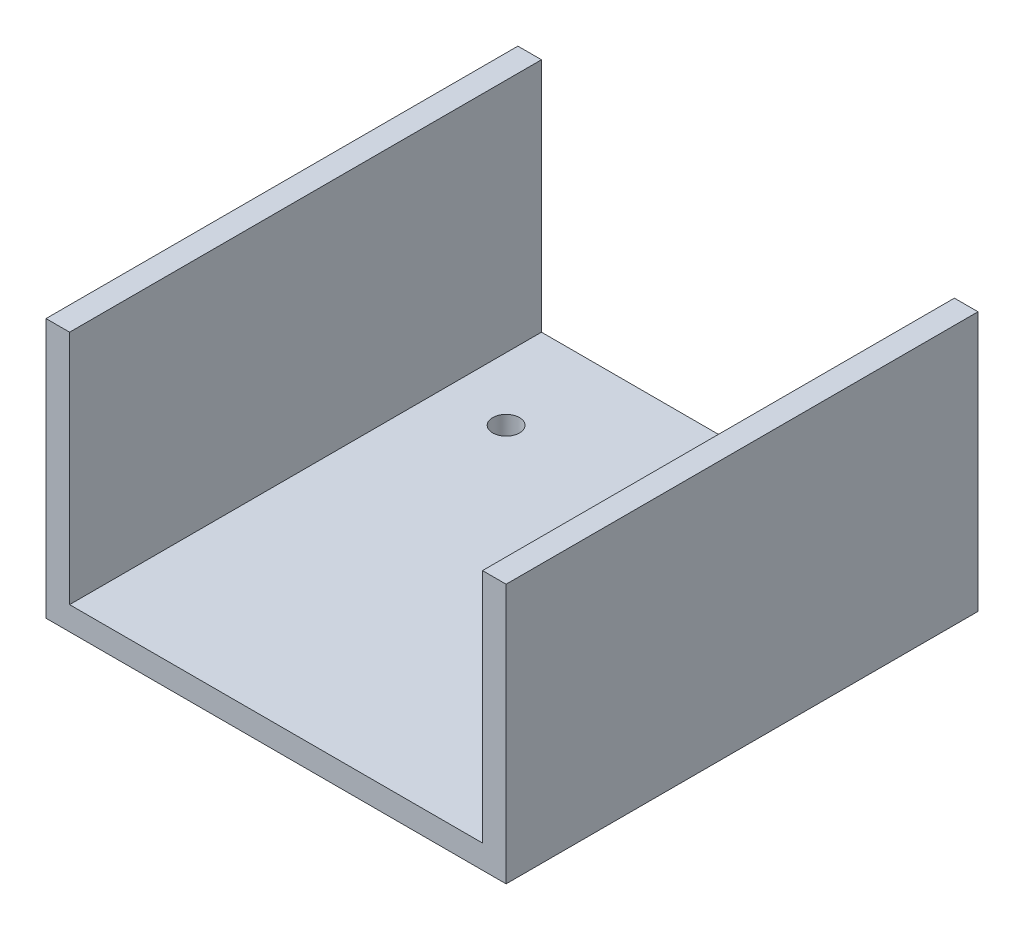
ISO-10303-21;
HEADER;
FILE_DESCRIPTION(('STEP AP214'),'2;1');
FILE_NAME('part.step','',(''),(''),'','','');
FILE_SCHEMA(('AUTOMOTIVE_DESIGN { 1 0 10303 214 1 1 1 1 }'));
ENDSEC;
DATA;
#1=APPLICATION_CONTEXT('core data for automotive mechanical design processes');
#2=APPLICATION_PROTOCOL_DEFINITION('international standard','automotive_design',2000,#1);
#3=PRODUCT_CONTEXT('',#1,'mechanical');
#4=PRODUCT('Part','Part','',(#3));
#5=PRODUCT_RELATED_PRODUCT_CATEGORY('part','',(#4));
#6=PRODUCT_DEFINITION_FORMATION('','',#4);
#7=PRODUCT_DEFINITION_CONTEXT('part definition',#1,'design');
#8=PRODUCT_DEFINITION('design','',#6,#7);
#9=PRODUCT_DEFINITION_SHAPE('','',#8);
#10=(LENGTH_UNIT() NAMED_UNIT(*) SI_UNIT(.MILLI.,.METRE.));
#11=(NAMED_UNIT(*) PLANE_ANGLE_UNIT() SI_UNIT($,.RADIAN.));
#12=(NAMED_UNIT(*) SI_UNIT($,.STERADIAN.) SOLID_ANGLE_UNIT());
#13=UNCERTAINTY_MEASURE_WITH_UNIT(LENGTH_MEASURE(1.E-05),#10,'distance_accuracy_value','');
#14=(GEOMETRIC_REPRESENTATION_CONTEXT(3) GLOBAL_UNCERTAINTY_ASSIGNED_CONTEXT((#13)) GLOBAL_UNIT_ASSIGNED_CONTEXT((#10,
#11,#12)) REPRESENTATION_CONTEXT('',''));
#15=CARTESIAN_POINT('',(0.,0.,0.));
#16=DIRECTION('',(0.,0.,1.));
#17=DIRECTION('',(1.,0.,0.));
#18=AXIS2_PLACEMENT_3D('',#15,#16,#17);
#19=CARTESIAN_POINT('',(52.5,-27.,120.));
#20=DIRECTION('',(1.,0.,0.));
#21=DIRECTION('',(0.,0.,-1.));
#22=AXIS2_PLACEMENT_3D('',#19,#20,#21);
#23=PLANE('',#22);
#24=DIRECTION('',(0.,-1.,0.));
#25=VECTOR('',#24,1.);
#26=CARTESIAN_POINT('',(52.5,-27.,0.));
#27=LINE('',#26,#25);
#28=CARTESIAN_POINT('',(52.5,33.,0.));
#29=VERTEX_POINT('',#28);
#30=CARTESIAN_POINT('',(52.5,-27.,0.));
#31=VERTEX_POINT('',#30);
#32=EDGE_CURVE('E126',#29,#31,#27,.T.);
#33=ORIENTED_EDGE('',*,*,#32,.T.);
#34=DIRECTION('',(0.,0.,-1.));
#35=VECTOR('',#34,1.);
#36=CARTESIAN_POINT('',(52.5,-27.,120.));
#37=LINE('',#36,#35);
#38=CARTESIAN_POINT('',(52.5,-27.,120.));
#39=VERTEX_POINT('',#38);
#40=EDGE_CURVE('E11',#39,#31,#37,.T.);
#41=ORIENTED_EDGE('',*,*,#40,.F.);
#42=DIRECTION('',(0.,-1.,0.));
#43=VECTOR('',#42,1.);
#44=CARTESIAN_POINT('',(52.5,-27.,120.));
#45=LINE('',#44,#43);
#46=CARTESIAN_POINT('',(52.5,33.,120.));
#47=VERTEX_POINT('',#46);
#48=EDGE_CURVE('E141',#47,#39,#45,.T.);
#49=ORIENTED_EDGE('',*,*,#48,.F.);
#50=DIRECTION('',(0.,0.,-1.));
#51=VECTOR('',#50,1.);
#52=CARTESIAN_POINT('',(52.5,33.,120.));
#53=LINE('',#52,#51);
#54=EDGE_CURVE('E122',#47,#29,#53,.T.);
#55=ORIENTED_EDGE('',*,*,#54,.T.);
#56=EDGE_LOOP('',(#33,#41,#49,#55));
#57=FACE_BOUND('',#56,.T.);
#58=ADVANCED_FACE('F30',(#57),#23,.F.);
#59=CARTESIAN_POINT('',(-52.5,-27.,120.));
#60=DIRECTION('',(0.,-1.,0.));
#61=DIRECTION('',(0.,0.,-1.));
#62=AXIS2_PLACEMENT_3D('',#59,#60,#61);
#63=PLANE('',#62);
#64=CARTESIAN_POINT('',(-36.5,-27.,25.));
#65=DIRECTION('',(0.,-1.,0.));
#66=DIRECTION('',(0.,0.,-1.));
#67=AXIS2_PLACEMENT_3D('',#64,#65,#66);
#68=CIRCLE('',#67,3.39999999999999);
#69=CARTESIAN_POINT('',(-36.5,-27.,21.6));
#70=VERTEX_POINT('',#69);
#71=EDGE_CURVE('E179',#70,#70,#68,.T.);
#72=ORIENTED_EDGE('',*,*,#71,.T.);
#73=EDGE_LOOP('',(#72));
#74=FACE_BOUND('',#73,.T.);
#75=CARTESIAN_POINT('',(39.5,-27.,95.));
#76=DIRECTION('',(0.,-1.,0.));
#77=DIRECTION('',(0.,0.,-1.));
#78=AXIS2_PLACEMENT_3D('',#75,#76,#77);
#79=CIRCLE('',#78,3.39999999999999);
#80=CARTESIAN_POINT('',(39.5,-27.,91.6));
#81=VERTEX_POINT('',#80);
#82=EDGE_CURVE('E130',#81,#81,#79,.T.);
#83=ORIENTED_EDGE('',*,*,#82,.T.);
#84=EDGE_LOOP('',(#83));
#85=FACE_BOUND('',#84,.T.);
#86=DIRECTION('',(-1.,0.,0.));
#87=VECTOR('',#86,1.);
#88=CARTESIAN_POINT('',(-52.5,-27.,0.));
#89=LINE('',#88,#87);
#90=CARTESIAN_POINT('',(-52.5,-27.,0.));
#91=VERTEX_POINT('',#90);
#92=EDGE_CURVE('E129',#31,#91,#89,.T.);
#93=ORIENTED_EDGE('',*,*,#92,.T.);
#94=DIRECTION('',(0.,0.,-1.));
#95=VECTOR('',#94,1.);
#96=CARTESIAN_POINT('',(-52.5,-27.,120.));
#97=LINE('',#96,#95);
#98=CARTESIAN_POINT('',(-52.5,-27.,120.));
#99=VERTEX_POINT('',#98);
#100=EDGE_CURVE('E38',#99,#91,#97,.T.);
#101=ORIENTED_EDGE('',*,*,#100,.F.);
#102=DIRECTION('',(-1.,0.,0.));
#103=VECTOR('',#102,1.);
#104=CARTESIAN_POINT('',(-52.5,-27.,120.));
#105=LINE('',#104,#103);
#106=EDGE_CURVE('E89',#39,#99,#105,.T.);
#107=ORIENTED_EDGE('',*,*,#106,.F.);
#108=ORIENTED_EDGE('',*,*,#40,.T.);
#109=EDGE_LOOP('',(#93,#101,#107,#108));
#110=FACE_BOUND('',#109,.T.);
#111=ADVANCED_FACE('F200',(#74,#85,#110),#63,.F.);
#112=CARTESIAN_POINT('',(-52.5,-27.,120.));
#113=DIRECTION('',(-1.,0.,0.));
#114=DIRECTION('',(0.,-1.,0.));
#115=AXIS2_PLACEMENT_3D('',#112,#113,#114);
#116=PLANE('',#115);
#117=DIRECTION('',(0.,1.,0.));
#118=VECTOR('',#117,1.);
#119=CARTESIAN_POINT('',(-52.5,-27.,0.));
#120=LINE('',#119,#118);
#121=CARTESIAN_POINT('',(-52.5,33.,0.));
#122=VERTEX_POINT('',#121);
#123=EDGE_CURVE('E132',#91,#122,#120,.T.);
#124=ORIENTED_EDGE('',*,*,#123,.T.);
#125=DIRECTION('',(0.,0.,-1.));
#126=VECTOR('',#125,1.);
#127=CARTESIAN_POINT('',(-52.5,33.,120.));
#128=LINE('',#127,#126);
#129=CARTESIAN_POINT('',(-52.5,33.,120.));
#130=VERTEX_POINT('',#129);
#131=EDGE_CURVE('E148',#130,#122,#128,.T.);
#132=ORIENTED_EDGE('',*,*,#131,.F.);
#133=DIRECTION('',(0.,1.,0.));
#134=VECTOR('',#133,1.);
#135=CARTESIAN_POINT('',(-52.5,-27.,120.));
#136=LINE('',#135,#134);
#137=EDGE_CURVE('E156',#99,#130,#136,.T.);
#138=ORIENTED_EDGE('',*,*,#137,.F.);
#139=ORIENTED_EDGE('',*,*,#100,.T.);
#140=EDGE_LOOP('',(#124,#132,#138,#139));
#141=FACE_BOUND('',#140,.T.);
#142=ADVANCED_FACE('F154',(#141),#116,.F.);
#143=CARTESIAN_POINT('',(-52.5,33.,120.));
#144=DIRECTION('',(0.,-1.,0.));
#145=DIRECTION('',(1.,0.,0.));
#146=AXIS2_PLACEMENT_3D('',#143,#144,#145);
#147=PLANE('',#146);
#148=DIRECTION('',(-1.,0.,0.));
#149=VECTOR('',#148,1.);
#150=CARTESIAN_POINT('',(-52.5,33.,0.));
#151=LINE('',#150,#149);
#152=CARTESIAN_POINT('',(-58.5,33.,0.));
#153=VERTEX_POINT('',#152);
#154=EDGE_CURVE('E134',#122,#153,#151,.T.);
#155=ORIENTED_EDGE('',*,*,#154,.T.);
#156=DIRECTION('',(0.,0.,-1.));
#157=VECTOR('',#156,1.);
#158=CARTESIAN_POINT('',(-58.5,33.,120.));
#159=LINE('',#158,#157);
#160=CARTESIAN_POINT('',(-58.5,33.,120.));
#161=VERTEX_POINT('',#160);
#162=EDGE_CURVE('E145',#161,#153,#159,.T.);
#163=ORIENTED_EDGE('',*,*,#162,.F.);
#164=DIRECTION('',(-1.,0.,0.));
#165=VECTOR('',#164,1.);
#166=CARTESIAN_POINT('',(-52.5,33.,120.));
#167=LINE('',#166,#165);
#168=EDGE_CURVE('E168',#130,#161,#167,.T.);
#169=ORIENTED_EDGE('',*,*,#168,.F.);
#170=ORIENTED_EDGE('',*,*,#131,.T.);
#171=EDGE_LOOP('',(#155,#163,#169,#170));
#172=FACE_BOUND('',#171,.T.);
#173=ADVANCED_FACE('F164',(#172),#147,.F.);
#174=CARTESIAN_POINT('',(-58.5,33.,120.));
#175=DIRECTION('',(1.,0.,0.));
#176=DIRECTION('',(0.,1.,0.));
#177=AXIS2_PLACEMENT_3D('',#174,#175,#176);
#178=PLANE('',#177);
#179=DIRECTION('',(0.,-1.,0.));
#180=VECTOR('',#179,1.);
#181=CARTESIAN_POINT('',(-58.5,33.,0.));
#182=LINE('',#181,#180);
#183=CARTESIAN_POINT('',(-58.5,-33.,0.));
#184=VERTEX_POINT('',#183);
#185=EDGE_CURVE('E136',#153,#184,#182,.T.);
#186=ORIENTED_EDGE('',*,*,#185,.T.);
#187=DIRECTION('',(0.,0.,-1.));
#188=VECTOR('',#187,1.);
#189=CARTESIAN_POINT('',(-58.5,-33.,120.));
#190=LINE('',#189,#188);
#191=CARTESIAN_POINT('',(-58.5,-33.,120.));
#192=VERTEX_POINT('',#191);
#193=EDGE_CURVE('E117',#192,#184,#190,.T.);
#194=ORIENTED_EDGE('',*,*,#193,.F.);
#195=DIRECTION('',(0.,-1.,0.));
#196=VECTOR('',#195,1.);
#197=CARTESIAN_POINT('',(-58.5,33.,120.));
#198=LINE('',#197,#196);
#199=EDGE_CURVE('E108',#161,#192,#198,.T.);
#200=ORIENTED_EDGE('',*,*,#199,.F.);
#201=ORIENTED_EDGE('',*,*,#162,.T.);
#202=EDGE_LOOP('',(#186,#194,#200,#201));
#203=FACE_BOUND('',#202,.T.);
#204=ADVANCED_FACE('F167',(#203),#178,.F.);
#205=CARTESIAN_POINT('',(58.5,-33.,120.));
#206=DIRECTION('',(0.,1.,0.));
#207=DIRECTION('',(-1.,0.,0.));
#208=AXIS2_PLACEMENT_3D('',#205,#206,#207);
#209=PLANE('',#208);
#210=CARTESIAN_POINT('',(-36.5,-33.,25.));
#211=DIRECTION('',(0.,-1.,0.));
#212=DIRECTION('',(0.,0.,-1.));
#213=AXIS2_PLACEMENT_3D('',#210,#211,#212);
#214=CIRCLE('',#213,3.39999999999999);
#215=CARTESIAN_POINT('',(-36.5,-33.,21.6));
#216=VERTEX_POINT('',#215);
#217=EDGE_CURVE('E182',#216,#216,#214,.T.);
#218=ORIENTED_EDGE('',*,*,#217,.F.);
#219=EDGE_LOOP('',(#218));
#220=FACE_BOUND('',#219,.T.);
#221=CARTESIAN_POINT('',(39.5,-33.,95.));
#222=DIRECTION('',(0.,-1.,0.));
#223=DIRECTION('',(0.,0.,-1.));
#224=AXIS2_PLACEMENT_3D('',#221,#222,#223);
#225=CIRCLE('',#224,3.39999999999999);
#226=CARTESIAN_POINT('',(39.5,-33.,91.6));
#227=VERTEX_POINT('',#226);
#228=EDGE_CURVE('E176',#227,#227,#225,.T.);
#229=ORIENTED_EDGE('',*,*,#228,.F.);
#230=EDGE_LOOP('',(#229));
#231=FACE_BOUND('',#230,.T.);
#232=DIRECTION('',(1.,0.,0.));
#233=VECTOR('',#232,1.);
#234=CARTESIAN_POINT('',(58.5,-33.,0.));
#235=LINE('',#234,#233);
#236=CARTESIAN_POINT('',(58.5,-33.,0.));
#237=VERTEX_POINT('',#236);
#238=EDGE_CURVE('E116',#184,#237,#235,.T.);
#239=ORIENTED_EDGE('',*,*,#238,.T.);
#240=DIRECTION('',(0.,0.,-1.));
#241=VECTOR('',#240,1.);
#242=CARTESIAN_POINT('',(58.5,-33.,120.));
#243=LINE('',#242,#241);
#244=CARTESIAN_POINT('',(58.5,-33.,120.));
#245=VERTEX_POINT('',#244);
#246=EDGE_CURVE('E113',#245,#237,#243,.T.);
#247=ORIENTED_EDGE('',*,*,#246,.F.);
#248=DIRECTION('',(1.,0.,0.));
#249=VECTOR('',#248,1.);
#250=CARTESIAN_POINT('',(58.5,-33.,120.));
#251=LINE('',#250,#249);
#252=EDGE_CURVE('E102',#192,#245,#251,.T.);
#253=ORIENTED_EDGE('',*,*,#252,.F.);
#254=ORIENTED_EDGE('',*,*,#193,.T.);
#255=EDGE_LOOP('',(#239,#247,#253,#254));
#256=FACE_BOUND('',#255,.T.);
#257=ADVANCED_FACE('F114',(#220,#231,#256),#209,.F.);
#258=CARTESIAN_POINT('',(58.5,33.,120.));
#259=DIRECTION('',(-1.,0.,0.));
#260=DIRECTION('',(0.,0.,1.));
#261=AXIS2_PLACEMENT_3D('',#258,#259,#260);
#262=PLANE('',#261);
#263=DIRECTION('',(0.,1.,0.));
#264=VECTOR('',#263,1.);
#265=CARTESIAN_POINT('',(58.5,33.,0.));
#266=LINE('',#265,#264);
#267=CARTESIAN_POINT('',(58.5,33.,0.));
#268=VERTEX_POINT('',#267);
#269=EDGE_CURVE('E75',#237,#268,#266,.T.);
#270=ORIENTED_EDGE('',*,*,#269,.T.);
#271=DIRECTION('',(0.,0.,-1.));
#272=VECTOR('',#271,1.);
#273=CARTESIAN_POINT('',(58.5,33.,120.));
#274=LINE('',#273,#272);
#275=CARTESIAN_POINT('',(58.5,33.,120.));
#276=VERTEX_POINT('',#275);
#277=EDGE_CURVE('E118',#276,#268,#274,.T.);
#278=ORIENTED_EDGE('',*,*,#277,.F.);
#279=DIRECTION('',(0.,1.,0.));
#280=VECTOR('',#279,1.);
#281=CARTESIAN_POINT('',(58.5,33.,120.));
#282=LINE('',#281,#280);
#283=EDGE_CURVE('E106',#245,#276,#282,.T.);
#284=ORIENTED_EDGE('',*,*,#283,.F.);
#285=ORIENTED_EDGE('',*,*,#246,.T.);
#286=EDGE_LOOP('',(#270,#278,#284,#285));
#287=FACE_BOUND('',#286,.T.);
#288=ADVANCED_FACE('F120',(#287),#262,.F.);
#289=CARTESIAN_POINT('',(52.5,33.,120.));
#290=DIRECTION('',(0.,-1.,0.));
#291=DIRECTION('',(1.,0.,0.));
#292=AXIS2_PLACEMENT_3D('',#289,#290,#291);
#293=PLANE('',#292);
#294=DIRECTION('',(-1.,0.,0.));
#295=VECTOR('',#294,1.);
#296=CARTESIAN_POINT('',(52.5,33.,0.));
#297=LINE('',#296,#295);
#298=EDGE_CURVE('E81',#268,#29,#297,.T.);
#299=ORIENTED_EDGE('',*,*,#298,.T.);
#300=ORIENTED_EDGE('',*,*,#54,.F.);
#301=DIRECTION('',(-1.,0.,0.));
#302=VECTOR('',#301,1.);
#303=CARTESIAN_POINT('',(52.5,33.,120.));
#304=LINE('',#303,#302);
#305=EDGE_CURVE('E46',#276,#47,#304,.T.);
#306=ORIENTED_EDGE('',*,*,#305,.F.);
#307=ORIENTED_EDGE('',*,*,#277,.T.);
#308=EDGE_LOOP('',(#299,#300,#306,#307));
#309=FACE_BOUND('',#308,.T.);
#310=ADVANCED_FACE('F206',(#309),#293,.F.);
#311=CARTESIAN_POINT('',(52.5,33.,120.));
#312=DIRECTION('',(0.,0.,-1.));
#313=DIRECTION('',(-1.,0.,0.));
#314=AXIS2_PLACEMENT_3D('',#311,#312,#313);
#315=PLANE('',#314);
#316=ORIENTED_EDGE('',*,*,#48,.T.);
#317=ORIENTED_EDGE('',*,*,#106,.T.);
#318=ORIENTED_EDGE('',*,*,#137,.T.);
#319=ORIENTED_EDGE('',*,*,#168,.T.);
#320=ORIENTED_EDGE('',*,*,#199,.T.);
#321=ORIENTED_EDGE('',*,*,#252,.T.);
#322=ORIENTED_EDGE('',*,*,#283,.T.);
#323=ORIENTED_EDGE('',*,*,#305,.T.);
#324=EDGE_LOOP('',(#316,#317,#318,#319,#320,#321,#322,#323));
#325=FACE_BOUND('',#324,.T.);
#326=ADVANCED_FACE('F104',(#325),#315,.F.);
#327=CARTESIAN_POINT('',(52.5,33.,0.));
#328=DIRECTION('',(0.,0.,-1.));
#329=DIRECTION('',(-1.,0.,0.));
#330=AXIS2_PLACEMENT_3D('',#327,#328,#329);
#331=PLANE('',#330);
#332=ORIENTED_EDGE('',*,*,#32,.F.);
#333=ORIENTED_EDGE('',*,*,#298,.F.);
#334=ORIENTED_EDGE('',*,*,#269,.F.);
#335=ORIENTED_EDGE('',*,*,#238,.F.);
#336=ORIENTED_EDGE('',*,*,#185,.F.);
#337=ORIENTED_EDGE('',*,*,#154,.F.);
#338=ORIENTED_EDGE('',*,*,#123,.F.);
#339=ORIENTED_EDGE('',*,*,#92,.F.);
#340=EDGE_LOOP('',(#332,#333,#334,#335,#336,#337,#338,#339));
#341=FACE_BOUND('',#340,.T.);
#342=ADVANCED_FACE('F160',(#341),#331,.T.);
#343=CARTESIAN_POINT('',(39.5,-33.,95.));
#344=DIRECTION('',(0.,-1.,0.));
#345=DIRECTION('',(0.,0.,-1.));
#346=AXIS2_PLACEMENT_3D('',#343,#344,#345);
#347=CYLINDRICAL_SURFACE('',#346,3.39999999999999);
#348=ORIENTED_EDGE('',*,*,#228,.T.);
#349=EDGE_LOOP('',(#348));
#350=FACE_BOUND('',#349,.T.);
#351=ORIENTED_EDGE('',*,*,#82,.F.);
#352=EDGE_LOOP('',(#351));
#353=FACE_BOUND('',#352,.T.);
#354=ADVANCED_FACE('F194',(#350,#353),#347,.F.);
#355=CARTESIAN_POINT('',(-36.5,-33.,25.));
#356=DIRECTION('',(0.,-1.,0.));
#357=DIRECTION('',(0.,0.,-1.));
#358=AXIS2_PLACEMENT_3D('',#355,#356,#357);
#359=CYLINDRICAL_SURFACE('',#358,3.39999999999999);
#360=ORIENTED_EDGE('',*,*,#217,.T.);
#361=EDGE_LOOP('',(#360));
#362=FACE_BOUND('',#361,.T.);
#363=ORIENTED_EDGE('',*,*,#71,.F.);
#364=EDGE_LOOP('',(#363));
#365=FACE_BOUND('',#364,.T.);
#366=ADVANCED_FACE('F186',(#362,#365),#359,.F.);
#367=CLOSED_SHELL('',(#58,#111,#142,#173,#204,#257,#288,#310,#326,#342,#354,#366));
#368=MANIFOLD_SOLID_BREP('B2',#367);
#369=ADVANCED_BREP_SHAPE_REPRESENTATION('',(#18,#368),#14);
#370=SHAPE_DEFINITION_REPRESENTATION(#9,#369);
ENDSEC;
END-ISO-10303-21;
